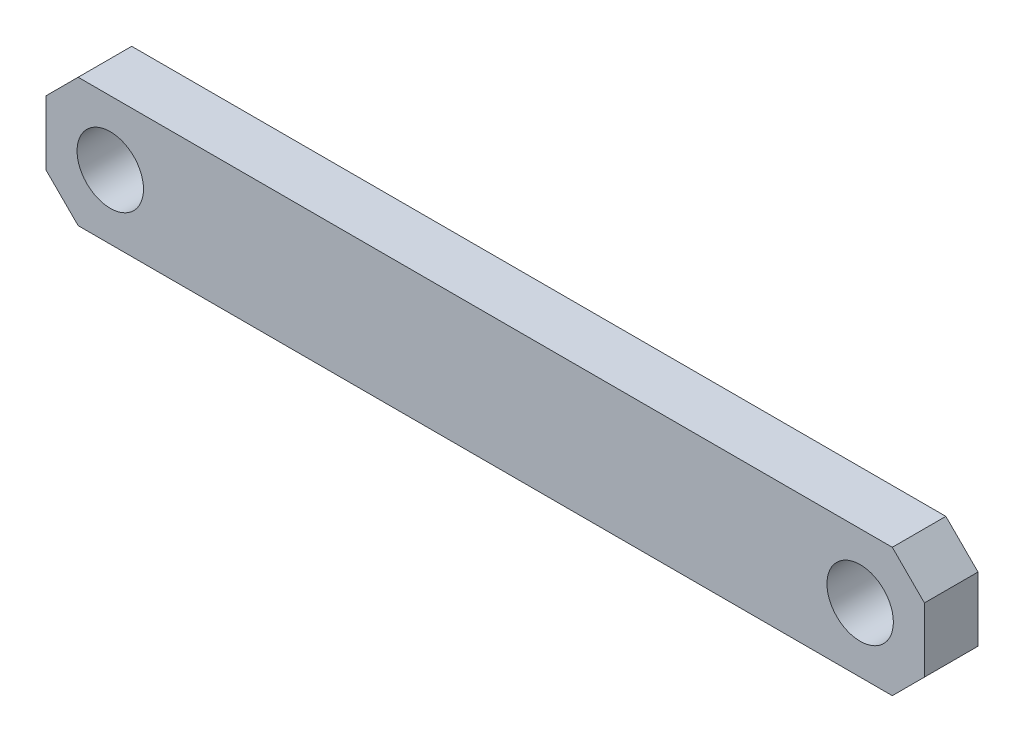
from build123d import *

# Parameters (mm, degrees)
LINK_PITCH70_DEPTH     = 2.5
SKETCH_2_R             = 3.1
PIVOT_BORES_D6_2_DEPTH = 250


with BuildPart() as part:
    # Sketch 1 → Link_Pitch70 (new, symmetric)
    with BuildSketch(Plane.XY):
        Polygon((-6, -3), (-3, -6), (73, -6), (76, -3), (76, 3), (73, 6), (-3, 6), (-6, 3), align=None)
    extrude(amount=LINK_PITCH70_DEPTH, both=True)

    # Sketch 2 → Pivot_Bores_D6_2 (cut, symmetric)
    with BuildSketch(Plane.XY):
        Circle(SKETCH_2_R)
        with Locations((70, 0)):
            Circle(SKETCH_2_R)
    extrude(amount=PIVOT_BORES_D6_2_DEPTH, both=True, mode=Mode.SUBTRACT)


solid = part.part
